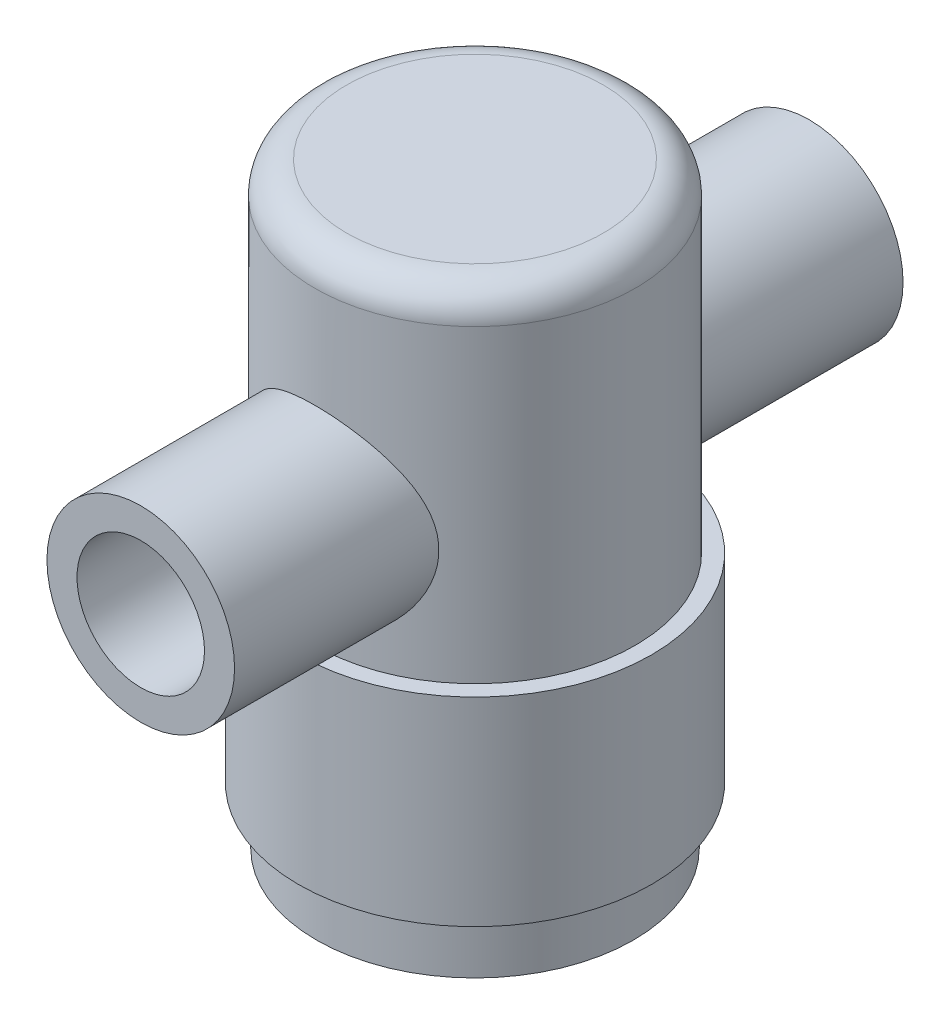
from build123d import *

# Parameters (mm, degrees)
FILLET1_R           = 1.5875
SKETCH2_R           = 4.6736
BOSS_EXTRUDE1_DEPTH = 16.6497
SKETCH3_R           = 0.79375
CUT_EXTRUDE1_DEPTH  = 46.506785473
CUT_EXTRUDE2_START  = -27.6479
SKETCH4_R           = 3.175
CUT_EXTRUDE2_DEPTH  = 27.6479
SKETCH5_R           = 3.175
CUT_EXTRUDE3_DEPTH  = 8.128
CUT_EXTRUDE4_START  = -8.128
SKETCH6_R           = 3.175
CUT_EXTRUDE4_DEPTH  = 8.128


with BuildPart() as part:
    # Sketch1 → Revolve1 (revolve)
    with BuildSketch(Plane.XY, mode=Mode.PRIVATE) as revolve1_sk:
        Polygon((-5.5626, 0), (-3.175, 2.3876), (-3.175, 27.6479), (0, 27.6479), (0, 29.7434), (-7.98195, 29.7434), (-7.98195, 12.7508), (-8.79475, 12.7508), (-8.79475, 2.8448), (-7.8994, 2.8448), (-7.8994, 0), align=None)
    revolve(revolve1_sk.sketch.rotate(Axis((0, 0, 0), (0, 1, 0)), 270), axis=Axis((0, 0, 0), (0, 1, 0)))

    # Fillet1
    fillet1_edges = [part.edges().sort_by_distance(p)[0] for p in [
        (0, 29.7434, 7.98195),
    ]]
    fillet(fillet1_edges, radius=FILLET1_R)

    # Sketch2 → Boss-Extrude1 (add, symmetric)
    with BuildSketch(Plane.XY):
        with Locations(Location((0, 18.4404, 0), (0, 0, 180))):
            Circle(SKETCH2_R)
    extrude(amount=BOSS_EXTRUDE1_DEPTH, both=True)

    # Sketch3 → Cut-Extrude1 (cut, through all)
    with BuildSketch(Plane.XY.offset(16.6497)):
        with Locations((0, 18.4404)):
            Circle(SKETCH3_R)
    extrude(amount=-CUT_EXTRUDE1_DEPTH, mode=Mode.SUBTRACT)

    # Sketch4 → Cut-Extrude2 (cut)
    with BuildSketch(Plane.XZ.offset(CUT_EXTRUDE2_START)):
        with Locations(Location((0, 0, 0), (0, 0, 270))):
            Circle(SKETCH4_R)
    extrude(amount=CUT_EXTRUDE2_DEPTH, mode=Mode.SUBTRACT)

    # Sketch5 → Cut-Extrude3 (cut)
    with BuildSketch(Plane.XY.offset(16.6497)):
        with Locations((0, 18.4404)):
            Circle(SKETCH5_R)
    extrude(amount=-CUT_EXTRUDE3_DEPTH, mode=Mode.SUBTRACT)

    # Sketch6 → Cut-Extrude4 (cut)
    with BuildSketch(Plane(origin=(0, 0, -16.6497), x_dir=(-1, 0, 0), z_dir=(0, 0, -1)).offset(CUT_EXTRUDE4_START)):
        with Locations(Location((0, 18.4404, 0), (0, 0, 180))):
            Circle(SKETCH6_R)
    extrude(amount=CUT_EXTRUDE4_DEPTH, mode=Mode.SUBTRACT)


solid = part.part
